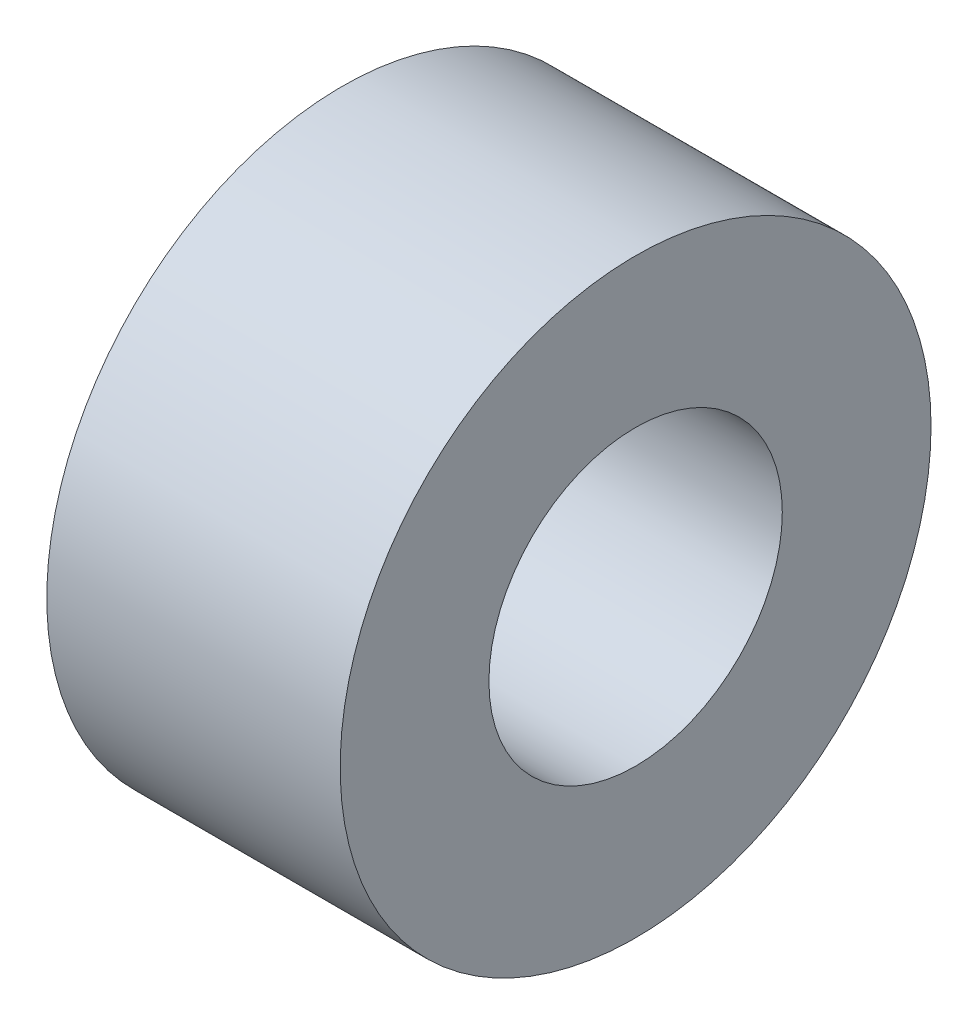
from build123d import *

# Parameters (mm, degrees)
SKETCH2_W = 25.4
SKETCH2_H = 12.877340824


with BuildPart() as part:
    # Sketch2 → Revolve1 (revolve)
    with BuildSketch(Plane.XY, mode=Mode.PRIVATE) as revolve1_sk:
        with Locations((-13.054681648, 19.138670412)):
            Rectangle(SKETCH2_W, SKETCH2_H)
    revolve(revolve1_sk.sketch.rotate(Axis((7.2971598, 0, 0), (-1, 0, 0)), 90), axis=Axis((7.2971598, 0, 0), (-1, 0, 0)))


solid = part.part
